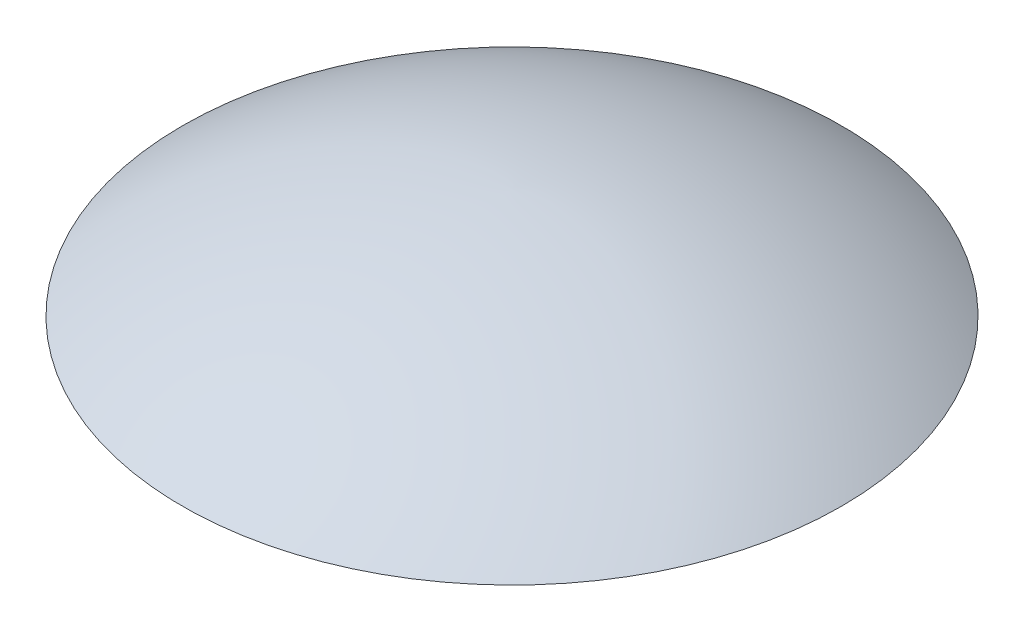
ISO-10303-21;
HEADER;
FILE_DESCRIPTION(('STEP AP214'),'2;1');
FILE_NAME('part.step','',(''),(''),'','','');
FILE_SCHEMA(('AUTOMOTIVE_DESIGN { 1 0 10303 214 1 1 1 1 }'));
ENDSEC;
DATA;
#1=APPLICATION_CONTEXT('core data for automotive mechanical design processes');
#2=APPLICATION_PROTOCOL_DEFINITION('international standard','automotive_design',2000,#1);
#3=PRODUCT_CONTEXT('',#1,'mechanical');
#4=PRODUCT('Part','Part','',(#3));
#5=PRODUCT_RELATED_PRODUCT_CATEGORY('part','',(#4));
#6=PRODUCT_DEFINITION_FORMATION('','',#4);
#7=PRODUCT_DEFINITION_CONTEXT('part definition',#1,'design');
#8=PRODUCT_DEFINITION('design','',#6,#7);
#9=PRODUCT_DEFINITION_SHAPE('','',#8);
#10=(LENGTH_UNIT() NAMED_UNIT(*) SI_UNIT(.MILLI.,.METRE.));
#11=(NAMED_UNIT(*) PLANE_ANGLE_UNIT() SI_UNIT($,.RADIAN.));
#12=(NAMED_UNIT(*) SI_UNIT($,.STERADIAN.) SOLID_ANGLE_UNIT());
#13=UNCERTAINTY_MEASURE_WITH_UNIT(LENGTH_MEASURE(1.E-05),#10,'distance_accuracy_value','');
#14=(GEOMETRIC_REPRESENTATION_CONTEXT(3) GLOBAL_UNCERTAINTY_ASSIGNED_CONTEXT((#13)) GLOBAL_UNIT_ASSIGNED_CONTEXT((#10,
#11,#12)) REPRESENTATION_CONTEXT('',''));
#15=CARTESIAN_POINT('',(0.,0.,0.));
#16=DIRECTION('',(0.,0.,1.));
#17=DIRECTION('',(1.,0.,0.));
#18=AXIS2_PLACEMENT_3D('',#15,#16,#17);
#19=CARTESIAN_POINT('',(2.30431540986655,-86.9129462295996,0.));
#20=DIRECTION('',(0.,0.,-1.));
#21=DIRECTION('',(-1.,0.,0.));
#22=AXIS2_PLACEMENT_3D('',#19,#20,#21);
#23=CIRCLE('',#22,106.937776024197);
#24=TRIMMED_CURVE('',#23,(PARAMETER_VALUE(-1.54924646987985)),
(PARAMETER_VALUE(1.54924646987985)),.T.,.PARAMETER.);
#25=CARTESIAN_POINT('',(0.,-86.9129462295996,0.));
#26=DIRECTION('',(0.,1.,0.));
#27=AXIS1_PLACEMENT('',#25,#26);
#28=SURFACE_OF_REVOLUTION('',#24,#27);
#29=CARTESIAN_POINT('',(0.,0.,0.));
#30=DIRECTION('',(0.,1.,0.));
#31=DIRECTION('',(-1.,0.,0.));
#32=AXIS2_PLACEMENT_3D('',#29,#30,#31);
#33=CIRCLE('',#32,60.);
#34=CARTESIAN_POINT('',(-60.,0.,0.));
#35=VERTEX_POINT('',#34);
#36=EDGE_CURVE('E11',#35,#35,#33,.T.);
#37=ORIENTED_EDGE('',*,*,#36,.T.);
#38=EDGE_LOOP('',(#37));
#39=FACE_BOUND('',#38,.T.);
#40=CARTESIAN_POINT('',(0.,20.,0.));
#41=VERTEX_POINT('',#40);
#42=VERTEX_LOOP('',#41);
#43=FACE_BOUND('',#42,.T.);
#44=ADVANCED_FACE('F34',(#39,#43),#28,.T.);
#45=CARTESIAN_POINT('',(0.,0.,0.));
#46=DIRECTION('',(0.,-1.,0.));
#47=DIRECTION('',(1.,0.,0.));
#48=AXIS2_PLACEMENT_3D('',#45,#46,#47);
#49=PLANE('',#48);
#50=CARTESIAN_POINT('',(0.,0.,0.));
#51=DIRECTION('',(0.,-1.,0.));
#52=DIRECTION('',(1.,0.,0.));
#53=AXIS2_PLACEMENT_3D('',#50,#51,#52);
#54=CIRCLE('',#53,54.6974482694);
#55=CARTESIAN_POINT('',(54.6974482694,0.,0.));
#56=VERTEX_POINT('',#55);
#57=EDGE_CURVE('E41',#56,#56,#54,.F.);
#58=ORIENTED_EDGE('',*,*,#57,.T.);
#59=EDGE_LOOP('',(#58));
#60=FACE_BOUND('',#59,.T.);
#61=ORIENTED_EDGE('',*,*,#36,.F.);
#62=EDGE_LOOP('',(#61));
#63=FACE_BOUND('',#62,.T.);
#64=ADVANCED_FACE('F49',(#60,#63),#49,.T.);
#65=CARTESIAN_POINT('',(2.30431540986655,-86.9129462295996,0.));
#66=DIRECTION('',(0.,0.,-1.));
#67=DIRECTION('',(-1.,0.,0.));
#68=AXIS2_PLACEMENT_3D('',#65,#66,#67);
#69=CIRCLE('',#68,103.937776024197);
#70=TRIMMED_CURVE('',#69,(PARAMETER_VALUE(-1.54862436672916)),
(PARAMETER_VALUE(1.54862436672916)),.T.,.PARAMETER.);
#71=CARTESIAN_POINT('',(0.,-86.9129462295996,0.));
#72=DIRECTION('',(0.,1.,0.));
#73=AXIS1_PLACEMENT('',#71,#72);
#74=SURFACE_OF_REVOLUTION('',#70,#73);
#75=ORIENTED_EDGE('',*,*,#57,.F.);
#76=EDGE_LOOP('',(#75));
#77=FACE_BOUND('',#76,.T.);
#78=CARTESIAN_POINT('',(0.,16.9992831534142,0.));
#79=VERTEX_POINT('',#78);
#80=VERTEX_LOOP('',#79);
#81=FACE_BOUND('',#80,.T.);
#82=ADVANCED_FACE('F47',(#77,#81),#74,.F.);
#83=CLOSED_SHELL('',(#44,#64,#82));
#84=MANIFOLD_SOLID_BREP('B2',#83);
#85=ADVANCED_BREP_SHAPE_REPRESENTATION('',(#18,#84),#14);
#86=SHAPE_DEFINITION_REPRESENTATION(#9,#85);
ENDSEC;
END-ISO-10303-21;
